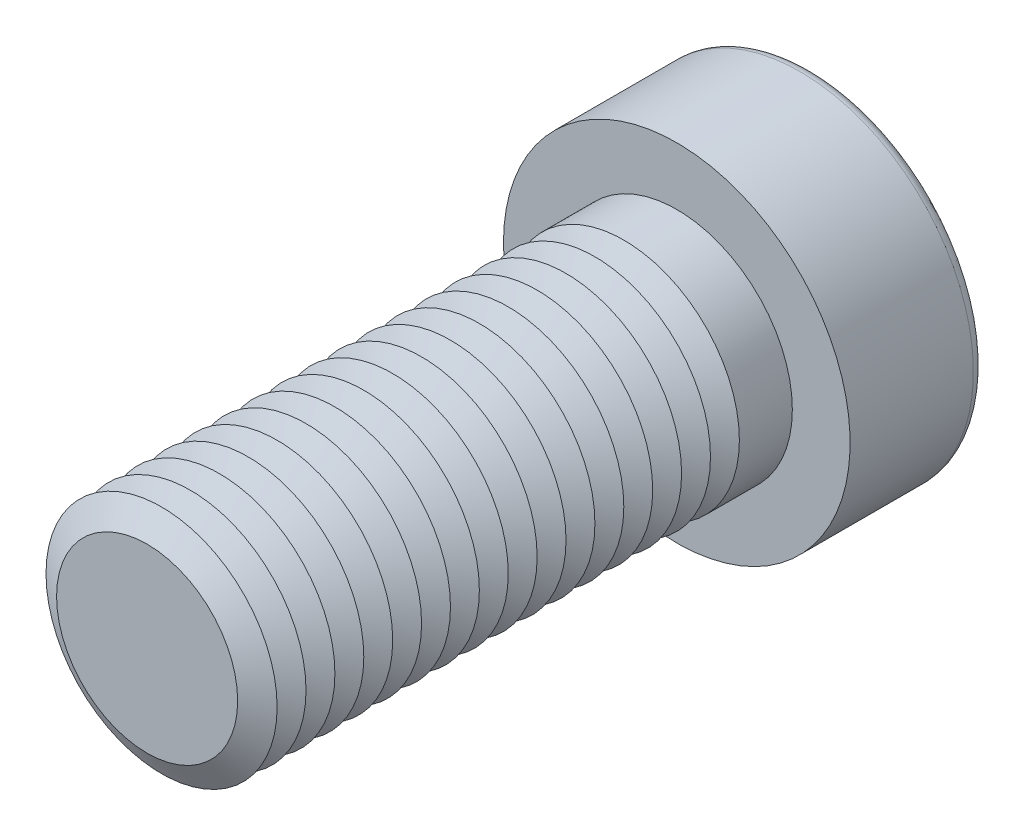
from build123d import *

# Parameters (mm, degrees)
SKETCH1_R           = 12
BOSS_EXTRUDE1_DEPTH = 55
SKETCH2_R           = 18
BOSS_EXTRUDE2_DEPTH = 14
CUT_EXTRUDE1_DEPTH  = 14.25
FILLET1_R           = 1.2
LPATTERN1_COUNT     = 17
LPATTERN1_PITCH     = 3


with BuildPart() as part:
    # Sketch1 → Boss-Extrude1 (new body)
    with BuildSketch(Plane.XY):
        Circle(SKETCH1_R)
    extrude(amount=BOSS_EXTRUDE1_DEPTH)

    # Sketch2 → Boss-Extrude2 (add)
    with BuildSketch(Plane(origin=(0, 0, 0), x_dir=(-1, 0, 0), z_dir=(0, 0, -1))):
        Circle(SKETCH2_R)
    extrude(amount=BOSS_EXTRUDE2_DEPTH)

    # Sketch3 → Cut-Extrude1 (cut)
    with BuildSketch(Plane(origin=(0, 0, -14), x_dir=(-1, 0, 0), z_dir=(0, 0, -1))):
        Polygon((-5.484827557, 9.5), (-10.969655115, 0), (-5.484827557, -9.5), (5.484827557, -9.5), (10.969655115, 0), (5.484827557, 9.5), align=None)
    extrude(amount=-CUT_EXTRUDE1_DEPTH, mode=Mode.SUBTRACT)

    # Fillet1
    fillet1_edges = [part.edges().sort_by_distance(p)[0] for p in [
        (18, 0, -14),
    ]]
    fillet(fillet1_edges, radius=FILLET1_R)

    # Cut-Extrude2 cone 1 section (on through the dimple's axis) → Cut-Extrude2 (revolve, cut)
    with BuildSketch(Plane(origin=(0, 0, 0.25), x_dir=(0, 1, 0), z_dir=(1, 0, 0))):
        Polygon((0, 0), (9.5, 0), (0, 5.484827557), align=None)
    revolve(axis=Axis((0, 0, 0.25), (0, 0, 1)), mode=Mode.SUBTRACT)

    # Cut-Extrude3 cone 1 section (on through the dimple's axis) → Cut-Extrude3 (revolve, cut)
    with BuildSketch(Plane(origin=(0, 0, -14), x_dir=(0, 1, 0), z_dir=(1, 0, 0))):
        Polygon((0, 0), (10.969655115, 0), (0, 2.939310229), align=None)
    revolve(axis=Axis((0, 0, -14), (0, 0, 1)), mode=Mode.SUBTRACT)

    # Sketch7 → Cut-Revolve1 (revolve, cut)
    with BuildSketch(Plane(origin=(0, 0, 0), x_dir=(0, 0, -1), z_dir=(1, 0, 0)), mode=Mode.PRIVATE) as cut_revolve1_sk:
        Polygon((-55, 9.401923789), (-53.5, 12), (-56.5, 12), align=None)
    cut_revolve1 = revolve(cut_revolve1_sk.sketch.rotate(Axis((0, 0, 55), (0, 0, -1)), 90), axis=Axis((0, 0, 55), (0, 0, -1)), mode=Mode.SUBTRACT)

    # LPattern1: Cut-Revolve1 ×17
    with Locations(*[(0, 0, -i * LPATTERN1_PITCH) for i in range(1, LPATTERN1_COUNT)]):
        add(cut_revolve1, mode=Mode.SUBTRACT)


solid = part.part
